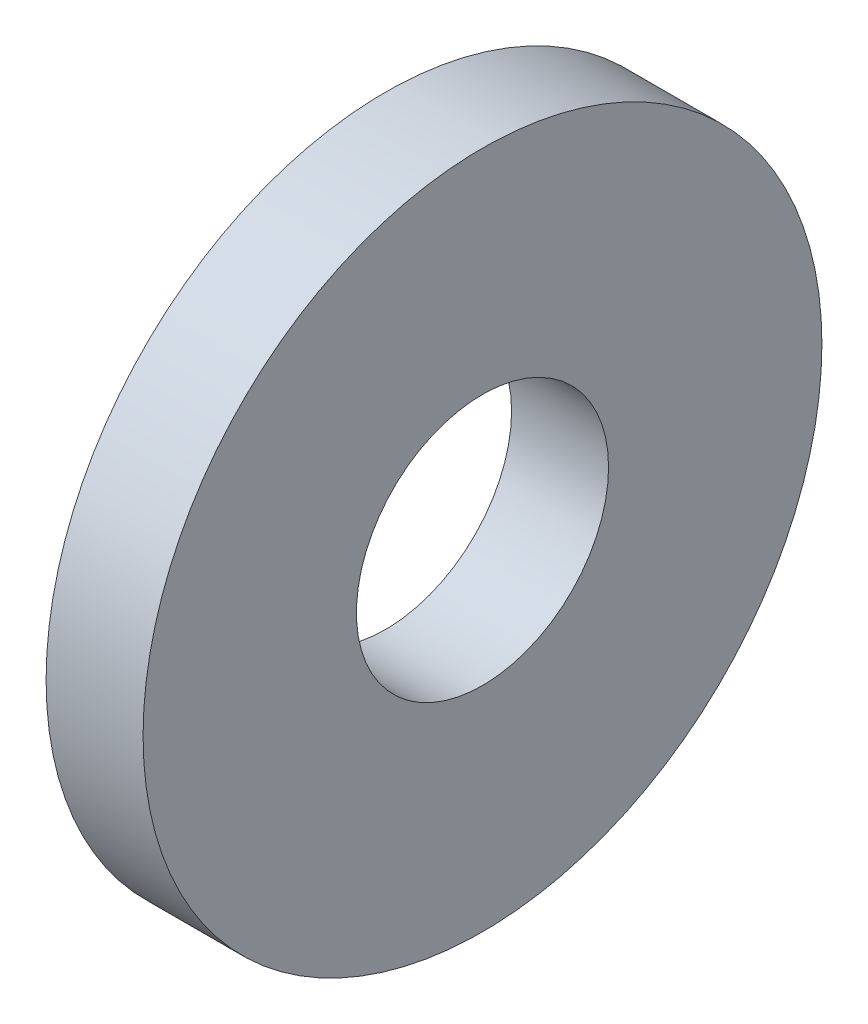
ISO-10303-21;
HEADER;
FILE_DESCRIPTION(('STEP AP214'),'2;1');
FILE_NAME('part.step','',(''),(''),'','','');
FILE_SCHEMA(('AUTOMOTIVE_DESIGN { 1 0 10303 214 1 1 1 1 }'));
ENDSEC;
DATA;
#1=APPLICATION_CONTEXT('core data for automotive mechanical design processes');
#2=APPLICATION_PROTOCOL_DEFINITION('international standard','automotive_design',2000,#1);
#3=PRODUCT_CONTEXT('',#1,'mechanical');
#4=PRODUCT('Part','Part','',(#3));
#5=PRODUCT_RELATED_PRODUCT_CATEGORY('part','',(#4));
#6=PRODUCT_DEFINITION_FORMATION('','',#4);
#7=PRODUCT_DEFINITION_CONTEXT('part definition',#1,'design');
#8=PRODUCT_DEFINITION('design','',#6,#7);
#9=PRODUCT_DEFINITION_SHAPE('','',#8);
#10=(LENGTH_UNIT() NAMED_UNIT(*) SI_UNIT(.MILLI.,.METRE.));
#11=(NAMED_UNIT(*) PLANE_ANGLE_UNIT() SI_UNIT($,.RADIAN.));
#12=(NAMED_UNIT(*) SI_UNIT($,.STERADIAN.) SOLID_ANGLE_UNIT());
#13=UNCERTAINTY_MEASURE_WITH_UNIT(LENGTH_MEASURE(1.E-05),#10,'distance_accuracy_value','');
#14=(GEOMETRIC_REPRESENTATION_CONTEXT(3) GLOBAL_UNCERTAINTY_ASSIGNED_CONTEXT((#13)) GLOBAL_UNIT_ASSIGNED_CONTEXT((#10,
#11,#12)) REPRESENTATION_CONTEXT('',''));
#15=CARTESIAN_POINT('',(0.,0.,0.));
#16=DIRECTION('',(0.,0.,1.));
#17=DIRECTION('',(1.,0.,0.));
#18=AXIS2_PLACEMENT_3D('',#15,#16,#17);
#19=CARTESIAN_POINT('',(5.,-0.860574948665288,-0.573716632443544));
#20=DIRECTION('',(1.,0.,0.));
#21=DIRECTION('',(0.,0.,-1.));
#22=AXIS2_PLACEMENT_3D('',#19,#20,#21);
#23=PLANE('',#22);
#24=CARTESIAN_POINT('',(5.,-0.860574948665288,-0.573716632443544));
#25=DIRECTION('',(1.,0.,0.));
#26=DIRECTION('',(0.,0.,-1.));
#27=AXIS2_PLACEMENT_3D('',#24,#25,#26);
#28=CIRCLE('',#27,17.5);
#29=CARTESIAN_POINT('',(5.,-0.860574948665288,-18.0737166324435));
#30=VERTEX_POINT('',#29);
#31=EDGE_CURVE('E10',#30,#30,#28,.T.);
#32=ORIENTED_EDGE('',*,*,#31,.T.);
#33=EDGE_LOOP('',(#32));
#34=FACE_BOUND('',#33,.T.);
#35=CARTESIAN_POINT('',(5.,-0.860574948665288,-0.573716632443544));
#36=DIRECTION('',(1.,0.,0.));
#37=DIRECTION('',(0.,0.,-1.));
#38=AXIS2_PLACEMENT_3D('',#35,#36,#37);
#39=CIRCLE('',#38,6.5);
#40=CARTESIAN_POINT('',(5.,-0.860574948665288,-7.07371663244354));
#41=VERTEX_POINT('',#40);
#42=EDGE_CURVE('E42',#41,#41,#39,.T.);
#43=ORIENTED_EDGE('',*,*,#42,.F.);
#44=EDGE_LOOP('',(#43));
#45=FACE_BOUND('',#44,.T.);
#46=ADVANCED_FACE('F31',(#34,#45),#23,.T.);
#47=CARTESIAN_POINT('',(0.,-0.860574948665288,-0.573716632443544));
#48=DIRECTION('',(1.,0.,0.));
#49=DIRECTION('',(0.,0.,-1.));
#50=AXIS2_PLACEMENT_3D('',#47,#48,#49);
#51=PLANE('',#50);
#52=CARTESIAN_POINT('',(0.,-0.860574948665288,-0.573716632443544));
#53=DIRECTION('',(1.,0.,0.));
#54=DIRECTION('',(0.,0.,-1.));
#55=AXIS2_PLACEMENT_3D('',#52,#53,#54);
#56=CIRCLE('',#55,17.5);
#57=CARTESIAN_POINT('',(0.,-0.860574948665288,-18.0737166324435));
#58=VERTEX_POINT('',#57);
#59=EDGE_CURVE('E35',#58,#58,#56,.T.);
#60=ORIENTED_EDGE('',*,*,#59,.F.);
#61=EDGE_LOOP('',(#60));
#62=FACE_BOUND('',#61,.T.);
#63=CARTESIAN_POINT('',(0.,-0.860574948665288,-0.573716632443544));
#64=DIRECTION('',(1.,0.,0.));
#65=DIRECTION('',(0.,0.,-1.));
#66=AXIS2_PLACEMENT_3D('',#63,#64,#65);
#67=CIRCLE('',#66,6.5);
#68=CARTESIAN_POINT('',(0.,-0.860574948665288,-7.07371663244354));
#69=VERTEX_POINT('',#68);
#70=EDGE_CURVE('E44',#69,#69,#67,.T.);
#71=ORIENTED_EDGE('',*,*,#70,.T.);
#72=EDGE_LOOP('',(#71));
#73=FACE_BOUND('',#72,.T.);
#74=ADVANCED_FACE('F54',(#62,#73),#51,.F.);
#75=CARTESIAN_POINT('',(5.,-0.860574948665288,-0.573716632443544));
#76=DIRECTION('',(-1.,0.,0.));
#77=DIRECTION('',(0.,0.,1.));
#78=AXIS2_PLACEMENT_3D('',#75,#76,#77);
#79=CYLINDRICAL_SURFACE('',#78,17.5);
#80=ORIENTED_EDGE('',*,*,#31,.F.);
#81=EDGE_LOOP('',(#80));
#82=FACE_BOUND('',#81,.T.);
#83=ORIENTED_EDGE('',*,*,#59,.T.);
#84=EDGE_LOOP('',(#83));
#85=FACE_BOUND('',#84,.T.);
#86=ADVANCED_FACE('F33',(#82,#85),#79,.T.);
#87=CARTESIAN_POINT('',(5.,-0.860574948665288,-0.573716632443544));
#88=DIRECTION('',(-1.,0.,0.));
#89=DIRECTION('',(0.,0.,1.));
#90=AXIS2_PLACEMENT_3D('',#87,#88,#89);
#91=CYLINDRICAL_SURFACE('',#90,6.5);
#92=ORIENTED_EDGE('',*,*,#42,.T.);
#93=EDGE_LOOP('',(#92));
#94=FACE_BOUND('',#93,.T.);
#95=ORIENTED_EDGE('',*,*,#70,.F.);
#96=EDGE_LOOP('',(#95));
#97=FACE_BOUND('',#96,.T.);
#98=ADVANCED_FACE('F50',(#94,#97),#91,.F.);
#99=CLOSED_SHELL('',(#46,#74,#86,#98));
#100=MANIFOLD_SOLID_BREP('B2',#99);
#101=ADVANCED_BREP_SHAPE_REPRESENTATION('',(#18,#100),#14);
#102=SHAPE_DEFINITION_REPRESENTATION(#9,#101);
ENDSEC;
END-ISO-10303-21;
